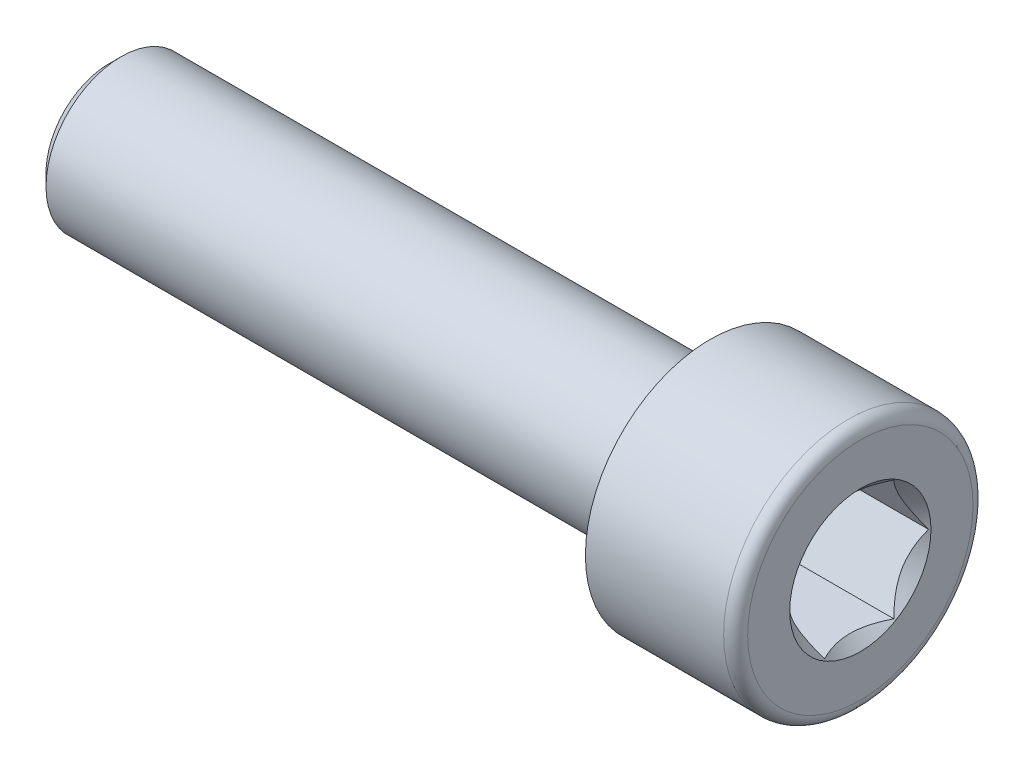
ISO-10303-21;
HEADER;
FILE_DESCRIPTION(('STEP AP214'),'2;1');
FILE_NAME('part.step','',(''),(''),'','','');
FILE_SCHEMA(('AUTOMOTIVE_DESIGN { 1 0 10303 214 1 1 1 1 }'));
ENDSEC;
DATA;
#1=APPLICATION_CONTEXT('core data for automotive mechanical design processes');
#2=APPLICATION_PROTOCOL_DEFINITION('international standard','automotive_design',2000,#1);
#3=PRODUCT_CONTEXT('',#1,'mechanical');
#4=PRODUCT('Part','Part','',(#3));
#5=PRODUCT_RELATED_PRODUCT_CATEGORY('part','',(#4));
#6=PRODUCT_DEFINITION_FORMATION('','',#4);
#7=PRODUCT_DEFINITION_CONTEXT('part definition',#1,'design');
#8=PRODUCT_DEFINITION('design','',#6,#7);
#9=PRODUCT_DEFINITION_SHAPE('','',#8);
#10=(LENGTH_UNIT() NAMED_UNIT(*) SI_UNIT(.MILLI.,.METRE.));
#11=(NAMED_UNIT(*) PLANE_ANGLE_UNIT() SI_UNIT($,.RADIAN.));
#12=(NAMED_UNIT(*) SI_UNIT($,.STERADIAN.) SOLID_ANGLE_UNIT());
#13=UNCERTAINTY_MEASURE_WITH_UNIT(LENGTH_MEASURE(1.E-05),#10,'distance_accuracy_value','');
#14=(GEOMETRIC_REPRESENTATION_CONTEXT(3) GLOBAL_UNCERTAINTY_ASSIGNED_CONTEXT((#13)) GLOBAL_UNIT_ASSIGNED_CONTEXT((#10,
#11,#12)) REPRESENTATION_CONTEXT('',''));
#15=CARTESIAN_POINT('',(0.,0.,0.));
#16=DIRECTION('',(0.,0.,1.));
#17=DIRECTION('',(1.,0.,0.));
#18=AXIS2_PLACEMENT_3D('',#15,#16,#17);
#19=CARTESIAN_POINT('',(-29.9999999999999,0.,0.));
#20=DIRECTION('',(-1.,0.,0.));
#21=DIRECTION('',(0.,0.,1.));
#22=AXIS2_PLACEMENT_3D('',#19,#20,#21);
#23=CYLINDRICAL_SURFACE('',#22,2.5);
#24=CARTESIAN_POINT('',(-19.5999999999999,0.,0.));
#25=DIRECTION('',(1.,0.,0.));
#26=DIRECTION('',(0.,0.,-1.));
#27=AXIS2_PLACEMENT_3D('',#24,#25,#26);
#28=CIRCLE('',#27,2.5);
#29=CARTESIAN_POINT('',(-19.5999999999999,0.,-2.50000000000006));
#30=VERTEX_POINT('',#29);
#31=EDGE_CURVE('E11',#30,#30,#28,.T.);
#32=ORIENTED_EDGE('',*,*,#31,.T.);
#33=EDGE_LOOP('',(#32));
#34=FACE_BOUND('',#33,.T.);
#35=CARTESIAN_POINT('',(0.,0.,0.));
#36=DIRECTION('',(-1.,0.,0.));
#37=DIRECTION('',(0.,0.,1.));
#38=AXIS2_PLACEMENT_3D('',#35,#36,#37);
#39=CIRCLE('',#38,2.5);
#40=CARTESIAN_POINT('',(0.,0.,2.5));
#41=VERTEX_POINT('',#40);
#42=EDGE_CURVE('E445',#41,#41,#39,.T.);
#43=ORIENTED_EDGE('',*,*,#42,.T.);
#44=EDGE_LOOP('',(#43));
#45=FACE_BOUND('',#44,.T.);
#46=ADVANCED_FACE('F348',(#34,#45),#23,.T.);
#47=CARTESIAN_POINT('',(-19.9999999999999,0.,0.));
#48=DIRECTION('',(1.,0.,0.));
#49=DIRECTION('',(0.,0.,-1.));
#50=AXIS2_PLACEMENT_3D('',#47,#48,#49);
#51=PLANE('',#50);
#52=CARTESIAN_POINT('',(-19.9999999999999,0.,0.));
#53=DIRECTION('',(1.,0.,0.));
#54=DIRECTION('',(0.,0.,-1.));
#55=AXIS2_PLACEMENT_3D('',#52,#53,#54);
#56=CIRCLE('',#55,2.1);
#57=CARTESIAN_POINT('',(-19.9999999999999,0.,-2.10000000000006));
#58=VERTEX_POINT('',#57);
#59=EDGE_CURVE('E355',#58,#58,#56,.F.);
#60=ORIENTED_EDGE('',*,*,#59,.T.);
#61=EDGE_LOOP('',(#60));
#62=FACE_BOUND('',#61,.T.);
#63=ADVANCED_FACE('F506',(#62),#51,.F.);
#64=CARTESIAN_POINT('',(4.65000000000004,0.,0.));
#65=DIRECTION('',(1.,0.,0.));
#66=DIRECTION('',(0.,0.,-1.));
#67=AXIS2_PLACEMENT_3D('',#64,#65,#66);
#68=CONICAL_SURFACE('',#67,2.,0.785398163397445);
#69=CARTESIAN_POINT('',(4.99999999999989,0.,0.));
#70=DIRECTION('',(-1.,0.,0.));
#71=DIRECTION('',(0.,0.,1.));
#72=AXIS2_PLACEMENT_3D('',#69,#70,#71);
#73=CIRCLE('',#72,2.35);
#74=CARTESIAN_POINT('',(4.99999999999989,0.,2.35));
#75=VERTEX_POINT('',#74);
#76=EDGE_CURVE('E457',#75,#75,#73,.T.);
#77=ORIENTED_EDGE('',*,*,#76,.F.);
#78=EDGE_LOOP('',(#77));
#79=FACE_BOUND('',#78,.T.);
#80=CARTESIAN_POINT('',(4.95951655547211,-2.00019999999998,1.15458506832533));
#81=CARTESIAN_POINT('',(4.91985416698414,-1.9314469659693,1.19427965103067));
#82=CARTESIAN_POINT('',(4.88252105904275,-1.8615442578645,1.2346379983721));
#83=CARTESIAN_POINT('',(4.81416476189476,-1.71900475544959,1.31693321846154));
#84=CARTESIAN_POINT('',(4.78317961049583,-1.64635440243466,1.35887791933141));
#85=CARTESIAN_POINT('',(4.73010129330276,-1.49985839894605,1.44345742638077));
#86=CARTESIAN_POINT('',(4.70787470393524,-1.42605006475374,1.48607068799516));
#87=CARTESIAN_POINT('',(4.67362989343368,-1.27680836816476,1.57223542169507));
#88=CARTESIAN_POINT('',(4.66158610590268,-1.20137956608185,1.61578426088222));
#89=CARTESIAN_POINT('',(4.65071958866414,-1.07138449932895,1.69083694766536));
#90=CARTESIAN_POINT('',(4.64911083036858,-1.01698621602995,1.72224381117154));
#91=CARTESIAN_POINT('',(4.65181995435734,-0.908278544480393,1.78500621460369));
#92=CARTESIAN_POINT('',(4.65613991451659,-0.853969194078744,1.81636173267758));
#93=CARTESIAN_POINT('',(4.67046064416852,-0.745863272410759,1.87877671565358));
#94=CARTESIAN_POINT('',(4.68046776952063,-0.692067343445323,1.90983580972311));
#95=CARTESIAN_POINT('',(4.70561350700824,-0.585405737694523,1.97141691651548));
#96=CARTESIAN_POINT('',(4.72075172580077,-0.532539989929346,2.00193897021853));
#97=CARTESIAN_POINT('',(4.76569558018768,-0.39712026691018,2.08012358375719));
#98=CARTESIAN_POINT('',(4.79888991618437,-0.315406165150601,2.1273012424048));
#99=CARTESIAN_POINT('',(4.85492689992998,-0.195252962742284,2.19667172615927));
#100=CARTESIAN_POINT('',(4.87461577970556,-0.155657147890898,2.21953238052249));
#101=CARTESIAN_POINT('',(4.91578839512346,-0.0771990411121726,2.26483018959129));
#102=CARTESIAN_POINT('',(4.93727102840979,-0.0383363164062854,2.28726759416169));
#103=CARTESIAN_POINT('',(4.95951655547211,0.000199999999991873,2.3095165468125));
#104=B_SPLINE_CURVE_WITH_KNOTS('',3,(#80,#81,#82,#83,#84,#85,#86,#87,#88,#89,#90,#91,#92,#93,
#94,#95,#96,#97,#98,#99,#100,#101,#102,#103),.UNSPECIFIED.,.F.,.F.,(4,2,2,2,2,2,2,2,2,2,2,4),
(0.,0.266420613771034,0.534393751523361,0.79811037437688,1.06116288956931,1.24939906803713,
1.43770123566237,1.62621426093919,1.81471283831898,2.11415604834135,2.26347170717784,
2.41269626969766),.UNSPECIFIED.);
#105=CARTESIAN_POINT('',(4.95940107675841,-2.,1.15470053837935));
#106=VERTEX_POINT('',#105);
#107=CARTESIAN_POINT('',(4.95940107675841,0.,2.30940107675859));
#108=VERTEX_POINT('',#107);
#109=EDGE_CURVE('E460',#106,#108,#104,.T.);
#110=ORIENTED_EDGE('',*,*,#109,.T.);
#111=CARTESIAN_POINT('',(4.95951655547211,-0.000199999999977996,2.3095165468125));
#112=CARTESIAN_POINT('',(4.91985416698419,0.0685530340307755,2.26982196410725));
#113=CARTESIAN_POINT('',(4.88252105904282,0.138455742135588,2.22946361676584));
#114=CARTESIAN_POINT('',(4.81416476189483,0.280995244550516,2.14716839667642));
#115=CARTESIAN_POINT('',(4.78317961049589,0.353645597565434,2.10522369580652));
#116=CARTESIAN_POINT('',(4.73010129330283,0.500141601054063,2.02064418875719));
#117=CARTESIAN_POINT('',(4.70787470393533,0.573949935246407,1.97803092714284));
#118=CARTESIAN_POINT('',(4.67362989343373,0.723191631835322,1.89186619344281));
#119=CARTESIAN_POINT('',(4.66158610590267,0.798620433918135,1.84831735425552));
#120=CARTESIAN_POINT('',(4.65071958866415,0.928615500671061,1.77326466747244));
#121=CARTESIAN_POINT('',(4.64911083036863,0.983013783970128,1.74185780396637));
#122=CARTESIAN_POINT('',(4.65181995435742,1.09172145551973,1.67909540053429));
#123=CARTESIAN_POINT('',(4.65613991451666,1.14603080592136,1.64773988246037));
#124=CARTESIAN_POINT('',(4.67046064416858,1.25413672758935,1.58532489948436));
#125=CARTESIAN_POINT('',(4.68046776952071,1.3079326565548,1.55426580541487));
#126=CARTESIAN_POINT('',(4.70561350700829,1.41459426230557,1.49268469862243));
#127=CARTESIAN_POINT('',(4.72075172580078,1.4674600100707,1.46216264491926));
#128=CARTESIAN_POINT('',(4.76569558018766,1.60287973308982,1.38397803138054));
#129=CARTESIAN_POINT('',(4.79888991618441,1.68459383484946,1.33680037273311));
#130=CARTESIAN_POINT('',(4.85492689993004,1.8047470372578,1.26742988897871));
#131=CARTESIAN_POINT('',(4.87461577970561,1.84434285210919,1.2445692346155));
#132=CARTESIAN_POINT('',(4.91578839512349,1.92280095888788,1.19927142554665));
#133=CARTESIAN_POINT('',(4.9372710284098,1.96166368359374,1.1768340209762));
#134=CARTESIAN_POINT('',(4.95951655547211,2.00019999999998,1.15458506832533));
#135=B_SPLINE_CURVE_WITH_KNOTS('',3,(#111,#112,#113,#114,#115,#116,#117,#118,#119,#120,#121,
#122,#123,#124,#125,#126,#127,#128,#129,#130,#131,#132,#133,#134),.UNSPECIFIED.,.F.,.F.,(4,2,2,
2,2,2,2,2,2,2,2,4),(0.,0.26642061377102,0.534393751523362,0.798110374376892,1.06116288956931,
1.24939906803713,1.43770123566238,1.62621426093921,1.81471283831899,2.11415604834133,
2.26347170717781,2.41269626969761),.UNSPECIFIED.);
#136=CARTESIAN_POINT('',(4.95940107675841,2.00000000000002,1.15470053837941));
#137=VERTEX_POINT('',#136);
#138=EDGE_CURVE('E362',#108,#137,#135,.T.);
#139=ORIENTED_EDGE('',*,*,#138,.T.);
#140=CARTESIAN_POINT('',(5.79426069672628,1.99999999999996,-2.42618534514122));
#141=CARTESIAN_POINT('',(5.74909013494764,2.00000000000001,-2.36763258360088));
#142=CARTESIAN_POINT('',(5.70431975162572,2.00000000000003,-2.30876620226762));
#143=CARTESIAN_POINT('',(5.61576271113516,2.00000000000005,-2.19027734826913));
#144=CARTESIAN_POINT('',(5.57197628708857,2.00000000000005,-2.13065470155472));
#145=CARTESIAN_POINT('',(5.48525899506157,2.00000000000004,-2.01008896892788));
#146=CARTESIAN_POINT('',(5.4423373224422,2.00000000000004,-1.94913924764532));
#147=CARTESIAN_POINT('',(5.35797202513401,2.00000000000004,-1.82622867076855));
#148=CARTESIAN_POINT('',(5.31652829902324,2.00000000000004,-1.76426788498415));
#149=CARTESIAN_POINT('',(5.23284053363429,2.00000000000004,-1.63512659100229));
#150=CARTESIAN_POINT('',(5.19071746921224,2.00000000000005,-1.5678672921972));
#151=CARTESIAN_POINT('',(5.10907589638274,2.00000000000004,-1.4317883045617));
#152=CARTESIAN_POINT('',(5.06955704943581,2.00000000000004,-1.36296882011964));
#153=CARTESIAN_POINT('',(4.99394415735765,2.00000000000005,-1.22371704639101));
#154=CARTESIAN_POINT('',(4.95784054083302,2.00000000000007,-1.15328999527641));
#155=CARTESIAN_POINT('',(4.88987372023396,2.00000000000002,-1.01043480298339));
#156=CARTESIAN_POINT('',(4.85800850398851,1.99999999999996,-0.938007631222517));
#157=CARTESIAN_POINT('',(4.80263091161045,1.99999999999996,-0.798432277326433));
#158=CARTESIAN_POINT('',(4.77859946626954,2.00000000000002,-0.731492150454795));
#159=CARTESIAN_POINT('',(4.73589336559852,2.00000000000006,-0.595892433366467));
#160=CARTESIAN_POINT('',(4.71721904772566,2.00000000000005,-0.527232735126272));
#161=CARTESIAN_POINT('',(4.68655509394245,2.00000000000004,-0.389808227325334));
#162=CARTESIAN_POINT('',(4.6744429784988,2.00000000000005,-0.321071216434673));
#163=CARTESIAN_POINT('',(4.65715855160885,2.00000000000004,-0.182725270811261));
#164=CARTESIAN_POINT('',(4.65198475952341,2.00000000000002,-0.113116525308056));
#165=CARTESIAN_POINT('',(4.64902612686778,2.00000000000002,0.0231290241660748));
#166=CARTESIAN_POINT('',(4.6509198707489,2.00000000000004,0.0897588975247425));
#167=CARTESIAN_POINT('',(4.66125026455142,2.00000000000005,0.222505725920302));
#168=CARTESIAN_POINT('',(4.66968750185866,2.00000000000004,0.288622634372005));
#169=CARTESIAN_POINT('',(4.69276803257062,2.00000000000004,0.420987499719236));
#170=CARTESIAN_POINT('',(4.70752150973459,2.00000000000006,0.487215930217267));
#171=CARTESIAN_POINT('',(4.74241355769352,2.00000000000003,0.618207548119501));
#172=CARTESIAN_POINT('',(4.76255184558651,2.,0.682970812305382));
#173=CARTESIAN_POINT('',(4.83204051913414,1.99999999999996,0.881622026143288));
#174=CARTESIAN_POINT('',(4.88907995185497,2.00000000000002,1.01281050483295));
#175=CARTESIAN_POINT('',(5.01602570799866,2.00000000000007,1.26907436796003));
#176=CARTESIAN_POINT('',(5.08597723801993,2.00000000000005,1.39412625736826));
#177=CARTESIAN_POINT('',(5.19522880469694,2.00000000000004,1.57489943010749));
#178=CARTESIAN_POINT('',(5.2313573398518,2.00000000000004,1.63257625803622));
#179=CARTESIAN_POINT('',(5.30516118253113,2.00000000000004,1.74693942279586));
#180=CARTESIAN_POINT('',(5.34283660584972,2.00000000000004,1.80362568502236));
#181=CARTESIAN_POINT('',(5.41914526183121,2.00000000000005,1.91568151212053));
#182=CARTESIAN_POINT('',(5.45776839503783,2.00000000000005,1.97105798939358));
#183=CARTESIAN_POINT('',(5.53605164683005,2.00000000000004,2.08105092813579));
#184=CARTESIAN_POINT('',(5.57571147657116,2.00000000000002,2.13566759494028));
#185=CARTESIAN_POINT('',(5.61579652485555,1.99999999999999,2.18996553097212));
#186=B_SPLINE_CURVE_WITH_KNOTS('',3,(#140,#141,#142,#143,#144,#145,#146,#147,#148,#149,#150,
#151,#152,#153,#154,#155,#156,#157,#158,#159,#160,#161,#162,#163,#164,#165,#166,#167,#168,#169,
#170,#171,#172,#173,#174,#175,#176,#177,#178,#179,#180,#181,#182,#183,#184,#185),.UNSPECIFIED.,
.F.,.F.,(4,2,2,2,2,2,2,2,2,2,2,2,2,2,2,2,2,2,2,2,2,2,4),(0.,0.221858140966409,0.44376830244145,
0.667388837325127,0.890993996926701,1.12903048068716,1.36703595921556,1.6043533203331,
1.84155761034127,2.05474341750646,2.26794265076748,2.47701207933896,2.68603688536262,
2.88567400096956,3.08532903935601,3.28861875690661,3.49189779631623,3.91981303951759,
4.34925589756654,4.55341049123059,4.7575803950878,4.96011357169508,5.1625909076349),.UNSPECIFIED.);
#187=CARTESIAN_POINT('',(4.95940107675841,2.00000000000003,-1.15470053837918));
#188=VERTEX_POINT('',#187);
#189=EDGE_CURVE('E496',#137,#188,#186,.F.);
#190=ORIENTED_EDGE('',*,*,#189,.T.);
#191=CARTESIAN_POINT('',(4.95951655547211,2.00020000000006,-1.15458506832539));
#192=CARTESIAN_POINT('',(4.91985416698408,1.93144696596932,-1.19427965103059));
#193=CARTESIAN_POINT('',(4.88252105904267,1.86154425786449,-1.23463799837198));
#194=CARTESIAN_POINT('',(4.81416476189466,1.71900475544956,-1.31693321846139));
#195=CARTESIAN_POINT('',(4.78317961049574,1.64635440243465,-1.35887791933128));
#196=CARTESIAN_POINT('',(4.73010129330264,1.49985839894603,-1.44345742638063));
#197=CARTESIAN_POINT('',(4.70787470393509,1.4260500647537,-1.48607068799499));
#198=CARTESIAN_POINT('',(4.6736298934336,1.27680836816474,-1.57223542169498));
#199=CARTESIAN_POINT('',(4.66158610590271,1.20137956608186,-1.61578426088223));
#200=CARTESIAN_POINT('',(4.65071958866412,1.07138449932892,-1.69083694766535));
#201=CARTESIAN_POINT('',(4.64911083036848,1.01698621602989,-1.72224381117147));
#202=CARTESIAN_POINT('',(4.65181995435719,0.9082785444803,-1.78500621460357));
#203=CARTESIAN_POINT('',(4.65613991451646,0.853969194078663,-1.81636173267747));
#204=CARTESIAN_POINT('',(4.6704606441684,0.745863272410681,-1.87877671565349));
#205=CARTESIAN_POINT('',(4.68046776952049,0.692067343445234,-1.909835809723));
#206=CARTESIAN_POINT('',(4.70561350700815,0.585405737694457,-1.97141691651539));
#207=CARTESIAN_POINT('',(4.72075172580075,0.532539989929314,-2.00193897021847));
#208=CARTESIAN_POINT('',(4.7656955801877,0.397120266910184,-2.08012358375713));
#209=CARTESIAN_POINT('',(4.79888991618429,0.315406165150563,-2.12730124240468));
#210=CARTESIAN_POINT('',(4.85492689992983,0.195252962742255,-2.19667172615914));
#211=CARTESIAN_POINT('',(4.8746157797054,0.155657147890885,-2.21953238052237));
#212=CARTESIAN_POINT('',(4.91578839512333,0.0771990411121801,-2.26483018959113));
#213=CARTESIAN_POINT('',(4.9372710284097,0.0383363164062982,-2.28726759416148));
#214=CARTESIAN_POINT('',(4.95951655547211,-0.000199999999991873,-2.30951654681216));
#215=B_SPLINE_CURVE_WITH_KNOTS('',3,(#191,#192,#193,#194,#195,#196,#197,#198,#199,#200,#201,
#202,#203,#204,#205,#206,#207,#208,#209,#210,#211,#212,#213,#214),.UNSPECIFIED.,.F.,.F.,(4,2,2,
2,2,2,2,2,2,2,2,4),(0.,0.266420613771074,0.534393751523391,0.798110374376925,1.06116288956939,
1.24939906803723,1.43770123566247,1.62621426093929,1.81471283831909,2.11415604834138,
2.26347170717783,2.41269626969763),.UNSPECIFIED.);
#216=CARTESIAN_POINT('',(4.95940107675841,0.,-2.30940107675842));
#217=VERTEX_POINT('',#216);
#218=EDGE_CURVE('E560',#188,#217,#215,.T.);
#219=ORIENTED_EDGE('',*,*,#218,.T.);
#220=CARTESIAN_POINT('',(4.95951655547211,0.000199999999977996,-2.30951654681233));
#221=CARTESIAN_POINT('',(4.91985416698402,-0.0685530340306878,-2.26982196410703));
#222=CARTESIAN_POINT('',(4.88252105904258,-0.138455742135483,-2.22946361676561));
#223=CARTESIAN_POINT('',(4.81416476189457,-0.280995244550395,-2.14716839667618));
#224=CARTESIAN_POINT('',(4.78317961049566,-0.353645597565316,-2.1052236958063));
#225=CARTESIAN_POINT('',(4.73010129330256,-0.500141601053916,-2.02064418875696));
#226=CARTESIAN_POINT('',(4.707874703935,-0.573949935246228,-1.97803092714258));
#227=CARTESIAN_POINT('',(4.67362989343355,-0.723191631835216,-1.89186619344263));
#228=CARTESIAN_POINT('',(4.66158610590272,-0.798620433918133,-1.84831735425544));
#229=CARTESIAN_POINT('',(4.65071958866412,-0.928615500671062,-1.7732646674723));
#230=CARTESIAN_POINT('',(4.64911083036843,-0.983013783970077,-1.74185780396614));
#231=CARTESIAN_POINT('',(4.65181995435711,-1.09172145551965,-1.679095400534));
#232=CARTESIAN_POINT('',(4.6561399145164,-1.14603080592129,-1.64773988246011));
#233=CARTESIAN_POINT('',(4.67046064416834,-1.25413672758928,-1.58532489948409));
#234=CARTESIAN_POINT('',(4.68046776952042,-1.30793265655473,-1.55426580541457));
#235=CARTESIAN_POINT('',(4.7056135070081,-1.41459426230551,-1.4926846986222));
#236=CARTESIAN_POINT('',(4.72075172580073,-1.46746001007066,-1.46216264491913));
#237=CARTESIAN_POINT('',(4.76569558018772,-1.60287973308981,-1.38397803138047));
#238=CARTESIAN_POINT('',(4.79888991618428,-1.68459383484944,-1.33680037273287));
#239=CARTESIAN_POINT('',(4.85492689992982,-1.80474703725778,-1.2674298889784));
#240=CARTESIAN_POINT('',(4.8746157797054,-1.84434285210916,-1.24456923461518));
#241=CARTESIAN_POINT('',(4.91578839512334,-1.92280095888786,-1.19927142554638));
#242=CARTESIAN_POINT('',(4.93727102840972,-1.96166368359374,-1.176834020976));
#243=CARTESIAN_POINT('',(4.95951655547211,-2.00019999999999,-1.15458506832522));
#244=B_SPLINE_CURVE_WITH_KNOTS('',3,(#220,#221,#222,#223,#224,#225,#226,#227,#228,#229,#230,
#231,#232,#233,#234,#235,#236,#237,#238,#239,#240,#241,#242,#243),.UNSPECIFIED.,.F.,.F.,(4,2,2,
2,2,2,2,2,2,2,2,4),(0.,0.266420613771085,0.534393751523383,0.798110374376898,1.06116288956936,
1.24939906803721,1.43770123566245,1.62621426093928,1.81471283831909,2.11415604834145,
2.26347170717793,2.41269626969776),.UNSPECIFIED.);
#245=CARTESIAN_POINT('',(4.95940107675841,-1.99999999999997,-1.15470053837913));
#246=VERTEX_POINT('',#245);
#247=EDGE_CURVE('E556',#217,#246,#244,.T.);
#248=ORIENTED_EDGE('',*,*,#247,.T.);
#249=CARTESIAN_POINT('',(5.7942607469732,-1.99999999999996,-2.42618541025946));
#250=CARTESIAN_POINT('',(5.74909018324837,-1.99999999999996,-2.36763264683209));
#251=CARTESIAN_POINT('',(5.70431979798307,-1.99999999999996,-2.30876626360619));
#252=CARTESIAN_POINT('',(5.61576275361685,-1.99999999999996,-2.19027740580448));
#253=CARTESIAN_POINT('',(5.571976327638,-1.99999999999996,-2.13065475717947));
#254=CARTESIAN_POINT('',(5.48525903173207,-1.99999999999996,-2.01008902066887));
#255=CARTESIAN_POINT('',(5.44233735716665,-1.99999999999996,-1.9491392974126));
#256=CARTESIAN_POINT('',(5.35797205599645,-1.99999999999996,-1.82622871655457));
#257=CARTESIAN_POINT('',(5.31652832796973,-1.99999999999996,-1.76426792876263));
#258=CARTESIAN_POINT('',(5.23284055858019,-1.99999999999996,-1.63512663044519));
#259=CARTESIAN_POINT('',(5.19071749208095,-1.99999999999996,-1.56786732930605));
#260=CARTESIAN_POINT('',(5.10907591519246,-1.99999999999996,-1.43178833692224));
#261=CARTESIAN_POINT('',(5.06955706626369,-1.99999999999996,-1.36296885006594));
#262=CARTESIAN_POINT('',(4.99394417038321,-1.99999999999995,-1.22371707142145));
#263=CARTESIAN_POINT('',(4.95784055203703,-1.99999999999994,-1.1532900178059));
#264=CARTESIAN_POINT('',(4.8898737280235,-1.99999999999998,-1.01043482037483));
#265=CARTESIAN_POINT('',(4.85800851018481,-2.00000000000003,-0.938007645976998));
#266=CARTESIAN_POINT('',(4.80263091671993,-2.00000000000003,-0.798432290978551));
#267=CARTESIAN_POINT('',(4.77859947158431,-1.99999999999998,-0.731492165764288));
#268=CARTESIAN_POINT('',(4.73589337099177,-1.99999999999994,-0.595892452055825));
#269=CARTESIAN_POINT('',(4.7172190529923,-1.99999999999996,-0.527232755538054));
#270=CARTESIAN_POINT('',(4.68655509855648,-1.99999999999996,-0.389808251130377));
#271=CARTESIAN_POINT('',(4.67444298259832,-1.99999999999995,-0.321071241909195));
#272=CARTESIAN_POINT('',(4.65715855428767,-1.99999999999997,-0.182725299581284));
#273=CARTESIAN_POINT('',(4.65198476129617,-2.,-0.113116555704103));
#274=CARTESIAN_POINT('',(4.64902612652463,-2.,0.0231289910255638));
#275=CARTESIAN_POINT('',(4.65091986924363,-1.99999999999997,0.0897588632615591));
#276=CARTESIAN_POINT('',(4.6612502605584,-1.99999999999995,0.222505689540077));
#277=CARTESIAN_POINT('',(4.66968749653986,-1.99999999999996,0.288622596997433));
#278=CARTESIAN_POINT('',(4.69276802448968,-1.99999999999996,0.420987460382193));
#279=CARTESIAN_POINT('',(4.70752150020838,-1.99999999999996,0.48721588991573));
#280=CARTESIAN_POINT('',(4.74241354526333,-1.99999999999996,0.618207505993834));
#281=CARTESIAN_POINT('',(4.76255183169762,-1.99999999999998,0.682970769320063));
#282=CARTESIAN_POINT('',(4.83204049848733,-2.,0.88162197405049));
#283=CARTESIAN_POINT('',(4.88907992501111,-1.99999999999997,1.01281044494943));
#284=CARTESIAN_POINT('',(5.01602566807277,-1.99999999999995,1.26907429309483));
#285=CARTESIAN_POINT('',(5.08597719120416,-1.99999999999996,1.39412617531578));
#286=CARTESIAN_POINT('',(5.19522874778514,-1.99999999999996,1.57489933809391));
#287=CARTESIAN_POINT('',(5.23135727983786,-1.99999999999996,1.63257616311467));
#288=CARTESIAN_POINT('',(5.30516111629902,-1.99999999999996,1.7469393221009));
#289=CARTESIAN_POINT('',(5.3428365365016,-1.99999999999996,1.80362558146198));
#290=CARTESIAN_POINT('',(5.41914518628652,-1.99999999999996,1.915681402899));
#291=CARTESIAN_POINT('',(5.45776831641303,-1.99999999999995,1.97105787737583));
#292=CARTESIAN_POINT('',(5.53605156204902,-1.99999999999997,2.08105081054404));
#293=CARTESIAN_POINT('',(5.57571138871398,-1.99999999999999,2.13566747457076));
#294=CARTESIAN_POINT('',(5.61579643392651,-2.00000000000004,2.18996540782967));
#295=B_SPLINE_CURVE_WITH_KNOTS('',3,(#249,#250,#251,#252,#253,#254,#255,#256,#257,#258,#259,
#260,#261,#262,#263,#264,#265,#266,#267,#268,#269,#270,#271,#272,#273,#274,#275,#276,#277,#278,
#279,#280,#281,#282,#283,#284,#285,#286,#287,#288,#289,#290,#291,#292,#293,#294),.UNSPECIFIED.,
.F.,.F.,(4,2,2,2,2,2,2,2,2,2,2,2,2,2,2,2,2,2,2,2,2,2,4),(0.,0.221858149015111,0.443768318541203,
0.66738886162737,0.890994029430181,1.12903052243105,1.36703601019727,1.60435338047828,
1.84155767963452,2.0547434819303,2.26794271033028,2.4770121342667,2.68603693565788,
2.88567404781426,3.08532908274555,3.28861879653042,3.49189783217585,3.91981304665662,
4.34925587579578,4.55341045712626,4.75758034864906,4.96011351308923,5.16259083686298),.UNSPECIFIED.);
#296=EDGE_CURVE('E467',#246,#106,#295,.T.);
#297=ORIENTED_EDGE('',*,*,#296,.T.);
#298=EDGE_LOOP('',(#110,#139,#190,#219,#248,#297));
#299=FACE_BOUND('',#298,.T.);
#300=ADVANCED_FACE('F473',(#79,#299),#68,.F.);
#301=CARTESIAN_POINT('',(4.99999999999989,3.75000000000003,-1.11022302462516E-13));
#302=DIRECTION('',(-1.,0.,0.));
#303=DIRECTION('',(0.,0.,1.));
#304=AXIS2_PLACEMENT_3D('',#301,#302,#303);
#305=PLANE('',#304);
#306=CARTESIAN_POINT('',(4.99999999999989,0.,0.));
#307=DIRECTION('',(-1.,0.,0.));
#308=DIRECTION('',(0.,0.,1.));
#309=AXIS2_PLACEMENT_3D('',#306,#307,#308);
#310=CIRCLE('',#309,3.75);
#311=CARTESIAN_POINT('',(4.99999999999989,0.,3.75));
#312=VERTEX_POINT('',#311);
#313=EDGE_CURVE('E454',#312,#312,#310,.T.);
#314=ORIENTED_EDGE('',*,*,#313,.F.);
#315=EDGE_LOOP('',(#314));
#316=FACE_BOUND('',#315,.T.);
#317=ORIENTED_EDGE('',*,*,#76,.T.);
#318=EDGE_LOOP('',(#317));
#319=FACE_BOUND('',#318,.T.);
#320=ADVANCED_FACE('F538',(#316,#319),#305,.F.);
#321=CARTESIAN_POINT('',(4.59999999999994,0.,0.));
#322=DIRECTION('',(-1.,0.,0.));
#323=DIRECTION('',(0.,0.,1.));
#324=AXIS2_PLACEMENT_3D('',#321,#322,#323);
#325=TOROIDAL_SURFACE('',#324,3.75,0.400000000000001);
#326=CARTESIAN_POINT('',(4.59999999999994,0.,0.));
#327=DIRECTION('',(-1.,0.,0.));
#328=DIRECTION('',(0.,0.,1.));
#329=AXIS2_PLACEMENT_3D('',#326,#327,#328);
#330=CIRCLE('',#329,4.15);
#331=CARTESIAN_POINT('',(4.59999999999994,0.,4.15));
#332=VERTEX_POINT('',#331);
#333=EDGE_CURVE('E451',#332,#332,#330,.T.);
#334=ORIENTED_EDGE('',*,*,#333,.F.);
#335=EDGE_LOOP('',(#334));
#336=FACE_BOUND('',#335,.T.);
#337=ORIENTED_EDGE('',*,*,#313,.T.);
#338=EDGE_LOOP('',(#337));
#339=FACE_BOUND('',#338,.T.);
#340=ADVANCED_FACE('F533',(#336,#339),#325,.T.);
#341=CARTESIAN_POINT('',(-29.9999999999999,0.,0.));
#342=DIRECTION('',(-1.,0.,0.));
#343=DIRECTION('',(0.,0.,1.));
#344=AXIS2_PLACEMENT_3D('',#341,#342,#343);
#345=CYLINDRICAL_SURFACE('',#344,4.15);
#346=CARTESIAN_POINT('',(0.,0.,0.));
#347=DIRECTION('',(-1.,0.,0.));
#348=DIRECTION('',(0.,0.,1.));
#349=AXIS2_PLACEMENT_3D('',#346,#347,#348);
#350=CIRCLE('',#349,4.15);
#351=CARTESIAN_POINT('',(0.,0.,4.15));
#352=VERTEX_POINT('',#351);
#353=EDGE_CURVE('E448',#352,#352,#350,.T.);
#354=ORIENTED_EDGE('',*,*,#353,.F.);
#355=EDGE_LOOP('',(#354));
#356=FACE_BOUND('',#355,.T.);
#357=ORIENTED_EDGE('',*,*,#333,.T.);
#358=EDGE_LOOP('',(#357));
#359=FACE_BOUND('',#358,.T.);
#360=ADVANCED_FACE('F528',(#356,#359),#345,.T.);
#361=CARTESIAN_POINT('',(0.,2.50000000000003,0.));
#362=DIRECTION('',(1.,0.,0.));
#363=DIRECTION('',(0.,0.,-1.));
#364=AXIS2_PLACEMENT_3D('',#361,#362,#363);
#365=PLANE('',#364);
#366=ORIENTED_EDGE('',*,*,#42,.F.);
#367=EDGE_LOOP('',(#366));
#368=FACE_BOUND('',#367,.T.);
#369=ORIENTED_EDGE('',*,*,#353,.T.);
#370=EDGE_LOOP('',(#369));
#371=FACE_BOUND('',#370,.T.);
#372=ADVANCED_FACE('F488',(#368,#371),#365,.F.);
#373=CARTESIAN_POINT('',(1.50000000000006,2.00000000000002,1.15470053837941));
#374=DIRECTION('',(-1.,0.,0.));
#375=DIRECTION('',(0.,0.,1.));
#376=AXIS2_PLACEMENT_3D('',#373,#374,#375);
#377=PLANE('',#376);
#378=DIRECTION('',(0.,-0.86602540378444,0.5));
#379=VECTOR('',#378,1.);
#380=CARTESIAN_POINT('',(1.50000000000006,2.00000000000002,1.15470053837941));
#381=LINE('',#380,#379);
#382=CARTESIAN_POINT('',(1.50000000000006,2.00000000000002,1.15470053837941));
#383=VERTEX_POINT('',#382);
#384=CARTESIAN_POINT('',(1.50000000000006,0.,2.30940107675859));
#385=VERTEX_POINT('',#384);
#386=EDGE_CURVE('E403',#383,#385,#381,.T.);
#387=ORIENTED_EDGE('',*,*,#386,.T.);
#388=DIRECTION('',(0.,-0.86602540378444,-0.500000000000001));
#389=VECTOR('',#388,1.);
#390=CARTESIAN_POINT('',(1.50000000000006,0.,2.30940107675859));
#391=LINE('',#390,#389);
#392=CARTESIAN_POINT('',(1.50000000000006,-1.99999999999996,1.15470053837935));
#393=VERTEX_POINT('',#392);
#394=EDGE_CURVE('E411',#385,#393,#391,.T.);
#395=ORIENTED_EDGE('',*,*,#394,.T.);
#396=DIRECTION('',(0.,0.,-1.));
#397=VECTOR('',#396,1.);
#398=CARTESIAN_POINT('',(1.50000000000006,-1.99999999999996,1.15470053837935));
#399=LINE('',#398,#397);
#400=CARTESIAN_POINT('',(1.50000000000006,-1.99999999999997,-1.15470053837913));
#401=VERTEX_POINT('',#400);
#402=EDGE_CURVE('E417',#393,#401,#399,.T.);
#403=ORIENTED_EDGE('',*,*,#402,.T.);
#404=DIRECTION('',(0.,0.86602540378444,-0.5));
#405=VECTOR('',#404,1.);
#406=CARTESIAN_POINT('',(1.50000000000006,-1.99999999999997,-1.15470053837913));
#407=LINE('',#406,#405);
#408=CARTESIAN_POINT('',(1.50000000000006,0.,-2.30940107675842));
#409=VERTEX_POINT('',#408);
#410=EDGE_CURVE('E426',#401,#409,#407,.T.);
#411=ORIENTED_EDGE('',*,*,#410,.T.);
#412=DIRECTION('',(0.,0.86602540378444,0.500000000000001));
#413=VECTOR('',#412,1.);
#414=CARTESIAN_POINT('',(1.50000000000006,0.,-2.30940107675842));
#415=LINE('',#414,#413);
#416=CARTESIAN_POINT('',(1.50000000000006,2.00000000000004,-1.15470053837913));
#417=VERTEX_POINT('',#416);
#418=EDGE_CURVE('E429',#409,#417,#415,.T.);
#419=ORIENTED_EDGE('',*,*,#418,.T.);
#420=DIRECTION('',(0.,0.,1.));
#421=VECTOR('',#420,1.);
#422=CARTESIAN_POINT('',(1.50000000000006,2.00000000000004,-1.15470053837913));
#423=LINE('',#422,#421);
#424=EDGE_CURVE('E408',#417,#383,#423,.T.);
#425=ORIENTED_EDGE('',*,*,#424,.T.);
#426=EDGE_LOOP('',(#387,#395,#403,#411,#419,#425));
#427=FACE_BOUND('',#426,.T.);
#428=CARTESIAN_POINT('',(1.50000000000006,0.,0.));
#429=DIRECTION('',(-1.,0.,0.));
#430=DIRECTION('',(0.,0.,1.));
#431=AXIS2_PLACEMENT_3D('',#428,#429,#430);
#432=CIRCLE('',#431,1.82679491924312);
#433=CARTESIAN_POINT('',(1.50000000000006,0.,1.82679491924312));
#434=VERTEX_POINT('',#433);
#435=EDGE_CURVE('E434',#434,#434,#432,.F.);
#436=ORIENTED_EDGE('',*,*,#435,.F.);
#437=EDGE_LOOP('',(#436));
#438=FACE_BOUND('',#437,.T.);
#439=ADVANCED_FACE('F419',(#427,#438),#377,.F.);
#440=CARTESIAN_POINT('',(1.50000000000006,2.00000000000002,1.15470053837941));
#441=DIRECTION('',(0.,0.500000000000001,0.866025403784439));
#442=DIRECTION('',(0.,-0.86602540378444,0.5));
#443=AXIS2_PLACEMENT_3D('',#440,#441,#442);
#444=PLANE('',#443);
#445=ORIENTED_EDGE('',*,*,#138,.F.);
#446=DIRECTION('',(1.,0.,0.));
#447=VECTOR('',#446,1.);
#448=CARTESIAN_POINT('',(1.50000000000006,0.,2.30940107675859));
#449=LINE('',#448,#447);
#450=EDGE_CURVE('E399',#385,#108,#449,.T.);
#451=ORIENTED_EDGE('',*,*,#450,.F.);
#452=ORIENTED_EDGE('',*,*,#386,.F.);
#453=DIRECTION('',(1.,0.,0.));
#454=VECTOR('',#453,1.);
#455=CARTESIAN_POINT('',(1.50000000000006,2.00000000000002,1.15470053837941));
#456=LINE('',#455,#454);
#457=EDGE_CURVE('E432',#383,#137,#456,.T.);
#458=ORIENTED_EDGE('',*,*,#457,.T.);
#459=EDGE_LOOP('',(#445,#451,#452,#458));
#460=FACE_BOUND('',#459,.T.);
#461=ADVANCED_FACE('F401',(#460),#444,.F.);
#462=CARTESIAN_POINT('',(1.50000000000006,2.00000000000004,-1.15470053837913));
#463=DIRECTION('',(0.,1.,0.));
#464=DIRECTION('',(0.,0.,1.));
#465=AXIS2_PLACEMENT_3D('',#462,#463,#464);
#466=PLANE('',#465);
#467=ORIENTED_EDGE('',*,*,#189,.F.);
#468=ORIENTED_EDGE('',*,*,#457,.F.);
#469=ORIENTED_EDGE('',*,*,#424,.F.);
#470=DIRECTION('',(1.,0.,0.));
#471=VECTOR('',#470,1.);
#472=CARTESIAN_POINT('',(1.50000000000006,2.00000000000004,-1.15470053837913));
#473=LINE('',#472,#471);
#474=EDGE_CURVE('E435',#417,#188,#473,.T.);
#475=ORIENTED_EDGE('',*,*,#474,.T.);
#476=EDGE_LOOP('',(#467,#468,#469,#475));
#477=FACE_BOUND('',#476,.T.);
#478=ADVANCED_FACE('F487',(#477),#466,.F.);
#479=CARTESIAN_POINT('',(1.50000000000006,0.,-2.30940107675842));
#480=DIRECTION('',(0.,0.5,-0.866025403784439));
#481=DIRECTION('',(0.,0.86602540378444,0.500000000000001));
#482=AXIS2_PLACEMENT_3D('',#479,#480,#481);
#483=PLANE('',#482);
#484=ORIENTED_EDGE('',*,*,#218,.F.);
#485=ORIENTED_EDGE('',*,*,#474,.F.);
#486=ORIENTED_EDGE('',*,*,#418,.F.);
#487=DIRECTION('',(1.,0.,0.));
#488=VECTOR('',#487,1.);
#489=CARTESIAN_POINT('',(1.50000000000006,0.,-2.30940107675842));
#490=LINE('',#489,#488);
#491=EDGE_CURVE('E438',#409,#217,#490,.T.);
#492=ORIENTED_EDGE('',*,*,#491,.T.);
#493=EDGE_LOOP('',(#484,#485,#486,#492));
#494=FACE_BOUND('',#493,.T.);
#495=ADVANCED_FACE('F559',(#494),#483,.F.);
#496=CARTESIAN_POINT('',(1.50000000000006,-1.99999999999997,-1.15470053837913));
#497=DIRECTION('',(0.,-0.500000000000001,-0.866025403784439));
#498=DIRECTION('',(0.,0.86602540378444,-0.5));
#499=AXIS2_PLACEMENT_3D('',#496,#497,#498);
#500=PLANE('',#499);
#501=ORIENTED_EDGE('',*,*,#247,.F.);
#502=ORIENTED_EDGE('',*,*,#491,.F.);
#503=ORIENTED_EDGE('',*,*,#410,.F.);
#504=DIRECTION('',(1.,0.,0.));
#505=VECTOR('',#504,1.);
#506=CARTESIAN_POINT('',(1.50000000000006,-1.99999999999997,-1.15470053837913));
#507=LINE('',#506,#505);
#508=EDGE_CURVE('E441',#401,#246,#507,.T.);
#509=ORIENTED_EDGE('',*,*,#508,.T.);
#510=EDGE_LOOP('',(#501,#502,#503,#509));
#511=FACE_BOUND('',#510,.T.);
#512=ADVANCED_FACE('F555',(#511),#500,.F.);
#513=CARTESIAN_POINT('',(1.50000000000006,-1.99999999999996,1.15470053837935));
#514=DIRECTION('',(0.,-1.,0.));
#515=DIRECTION('',(0.,0.,-1.));
#516=AXIS2_PLACEMENT_3D('',#513,#514,#515);
#517=PLANE('',#516);
#518=ORIENTED_EDGE('',*,*,#296,.F.);
#519=ORIENTED_EDGE('',*,*,#508,.F.);
#520=ORIENTED_EDGE('',*,*,#402,.F.);
#521=DIRECTION('',(1.,0.,0.));
#522=VECTOR('',#521,1.);
#523=CARTESIAN_POINT('',(1.50000000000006,-1.99999999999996,1.15470053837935));
#524=LINE('',#523,#522);
#525=EDGE_CURVE('E407',#393,#106,#524,.T.);
#526=ORIENTED_EDGE('',*,*,#525,.T.);
#527=EDGE_LOOP('',(#518,#519,#520,#526));
#528=FACE_BOUND('',#527,.T.);
#529=ADVANCED_FACE('F481',(#528),#517,.F.);
#530=CARTESIAN_POINT('',(1.50000000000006,0.,2.30940107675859));
#531=DIRECTION('',(0.,-0.5,0.866025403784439));
#532=DIRECTION('',(0.,-0.866025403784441,-0.500000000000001));
#533=AXIS2_PLACEMENT_3D('',#530,#531,#532);
#534=PLANE('',#533);
#535=ORIENTED_EDGE('',*,*,#109,.F.);
#536=ORIENTED_EDGE('',*,*,#525,.F.);
#537=ORIENTED_EDGE('',*,*,#394,.F.);
#538=ORIENTED_EDGE('',*,*,#450,.T.);
#539=EDGE_LOOP('',(#535,#536,#537,#538));
#540=FACE_BOUND('',#539,.T.);
#541=ADVANCED_FACE('F412',(#540),#534,.F.);
#542=CARTESIAN_POINT('',(0.445299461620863,0.,0.));
#543=DIRECTION('',(1.,0.,0.));
#544=DIRECTION('',(0.,0.,-1.));
#545=AXIS2_PLACEMENT_3D('',#542,#543,#544);
#546=CONICAL_SURFACE('',#545,0.,1.0471975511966);
#547=ORIENTED_EDGE('',*,*,#435,.T.);
#548=EDGE_LOOP('',(#547));
#549=FACE_BOUND('',#548,.T.);
#550=CARTESIAN_POINT('',(0.445299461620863,0.,0.));
#551=VERTEX_POINT('',#550);
#552=VERTEX_LOOP('',#551);
#553=FACE_BOUND('',#552,.T.);
#554=ADVANCED_FACE('F480',(#549,#553),#546,.F.);
#555=CARTESIAN_POINT('',(-19.9999999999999,0.,0.));
#556=DIRECTION('',(1.,0.,0.));
#557=DIRECTION('',(0.,0.,-1.));
#558=AXIS2_PLACEMENT_3D('',#555,#556,#557);
#559=CONICAL_SURFACE('',#558,2.1,0.785398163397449);
#560=ORIENTED_EDGE('',*,*,#31,.F.);
#561=EDGE_LOOP('',(#560));
#562=FACE_BOUND('',#561,.T.);
#563=ORIENTED_EDGE('',*,*,#59,.F.);
#564=EDGE_LOOP('',(#563));
#565=FACE_BOUND('',#564,.T.);
#566=ADVANCED_FACE('F508',(#562,#565),#559,.T.);
#567=CLOSED_SHELL('',(#46,#63,#300,#320,#340,#360,#372,#439,#461,#478,#495,#512,#529,#541,#554,#566));
#568=MANIFOLD_SOLID_BREP('B2',#567);
#569=ADVANCED_BREP_SHAPE_REPRESENTATION('',(#18,#568),#14);
#570=SHAPE_DEFINITION_REPRESENTATION(#9,#569);
ENDSEC;
END-ISO-10303-21;
